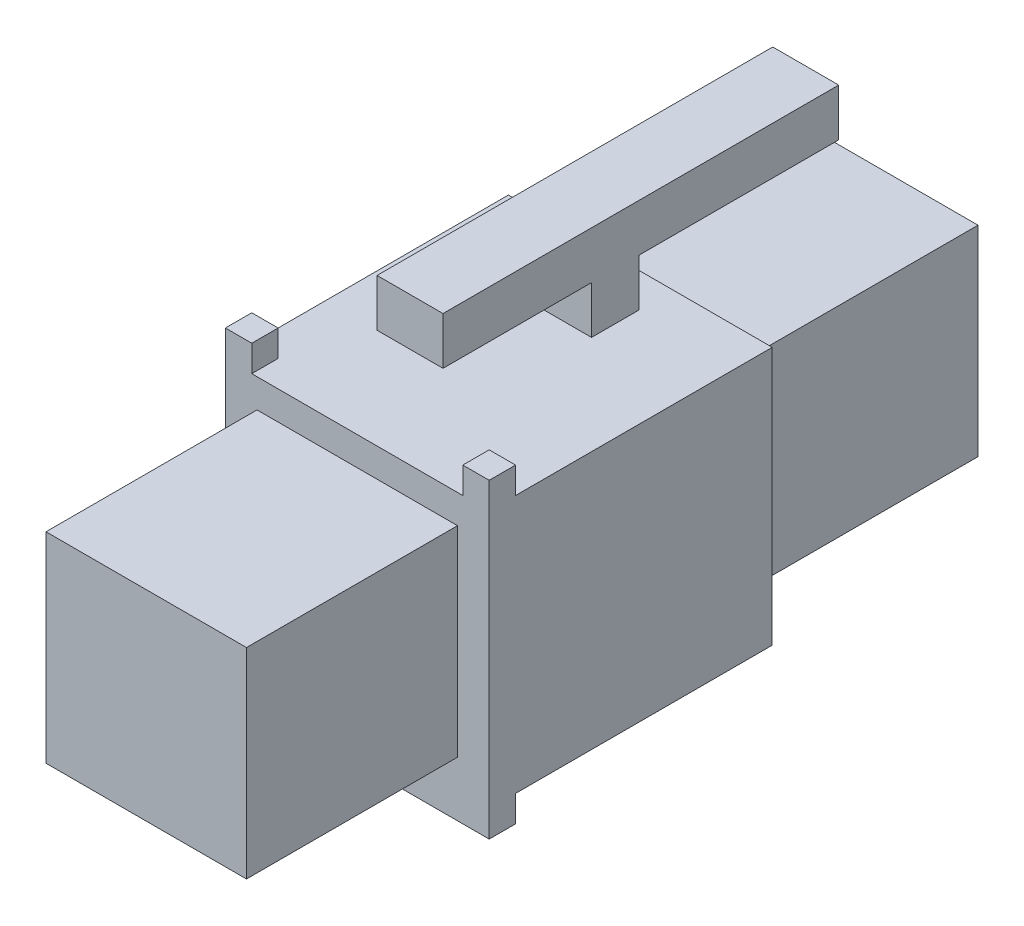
from build123d import *

# Parameters (mm, degrees)
SKETCH_1_W          = 10.73
SKETCH_1_H          = 9.78
EXTRUDE_1_DEPTH     = 5
SKETCH_2_W          = 1
SKETCH_2_H          = 1
EXTRUDE_2_DEPTH     = 10
SKETCH_3_W          = 7.6
SKETCH_3_H          = 7.6
EXTRUDE_3_DEPTH     = 9
EXTRUDE_4_DEPTH     = 1.25
SKETCH_5_W          = 8
SKETCH_5_H          = 1
CUT_EXTRUDE_1_DEPTH = 17.010662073
SKETCH_6_W          = 7.6
SKETCH_6_H          = 7.6
EXTRUDE_5_DEPTH     = 8


with BuildPart() as part:
    # Sketch 1 → Extrude 1 (new, symmetric)
    with BuildSketch(Plane(origin=(0, 0, 0), x_dir=(0, 0, -1), z_dir=(1, 0, 0))):
        with Locations((-5.365, 0)):
            Rectangle(SKETCH_1_W, SKETCH_1_H)
    extrude(amount=EXTRUDE_1_DEPTH, both=True)

    # Sketch 2 → Extrude 2 (add)
    with BuildSketch(Plane(origin=(5, 0, 0), x_dir=(0, 0, -1), z_dir=(1, 0, 0))):
        with Locations((-10.23, 5.39)):
            Rectangle(SKETCH_2_W, SKETCH_2_H)
        with Locations((-10.23, -5.39)):
            Rectangle(SKETCH_2_W, SKETCH_2_H)
    extrude(amount=-EXTRUDE_2_DEPTH)

    # Sketch 3 → Extrude 3 (add)
    with BuildSketch(Plane(origin=(0, 0, 0), x_dir=(-1, 0, 0), z_dir=(0, 0, -1))):
        Rectangle(SKETCH_3_W, SKETCH_3_H)
    extrude(amount=EXTRUDE_3_DEPTH)

    # Sketch 4 → Extrude 4 (add, symmetric)
    with BuildSketch(Plane(origin=(0, 0, 0), x_dir=(0, 0, -1), z_dir=(1, 0, 0))):
        Polygon((-8.73, 8.49), (6.27, 8.49), (6.27, 6.69), (-1.3, 6.69), (-1.3, 4.89), (-3.1, 4.89), (-3.1, 6.69), (-8.73, 6.69), align=None)
    extrude(amount=EXTRUDE_4_DEPTH, both=True)

    # Sketch 5 → Cut-Extrude 1 (cut, through all)
    with BuildSketch(Plane(origin=(0, 4.89, 0), x_dir=(1, 0, 0), z_dir=(0, 1, 0))):
        with Locations((0, -10.23)):
            Rectangle(SKETCH_5_W, SKETCH_5_H)
    extrude(amount=CUT_EXTRUDE_1_DEPTH, mode=Mode.SUBTRACT)

    # Sketch 6 → Extrude 5 (add)
    with BuildSketch(Plane.XY.offset(10.73)):
        Rectangle(SKETCH_6_W, SKETCH_6_H)
    extrude(amount=EXTRUDE_5_DEPTH)


solid = part.part
